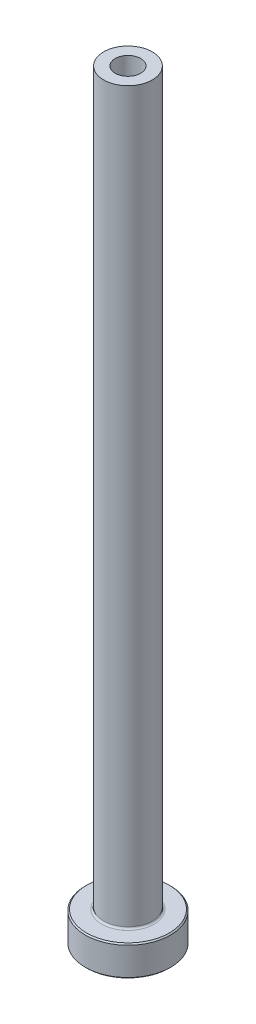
from build123d import *

# Parameters (mm, degrees)
FILLET1_R     = 0.3
CHAMFER1_SIZE = 0.2
CHAMFER3_SIZE = 0.5


with BuildPart() as part:
    # Sketch1 → Revolve1 (revolve)
    with BuildSketch(Plane.XY, mode=Mode.PRIVATE) as revolve1_sk:
        Polygon((-2.1, 125), (-4, 125), (-4, 5), (-7, 5), (-7, 0), (-2.35, 0), (-2.35, 68), (-2.1, 80), align=None)
    revolve(revolve1_sk.sketch.rotate(Axis((0, 92.187680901, 0), (0, -1, 0)), 270), axis=Axis((0, 92.187680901, 0), (0, -1, 0)))

    # Fillet1
    fillet1_edges = [part.edges().sort_by_distance(p)[0] for p in [
        (0, 5, -4),
    ]]
    fillet(fillet1_edges, radius=FILLET1_R)

    # Chamfer1
    chamfer1_edges = [part.edges().sort_by_distance(p)[0] for p in [
        (0, 0, -7),
        (0, 5, -7),
    ]]
    chamfer(chamfer1_edges, length=CHAMFER1_SIZE)

    # Chamfer3
    chamfer3_edges = [part.edges().sort_by_distance(p)[0] for p in [
        (0, 0, -2.35),
    ]]
    chamfer(chamfer3_edges, length=CHAMFER3_SIZE)


solid = part.part
